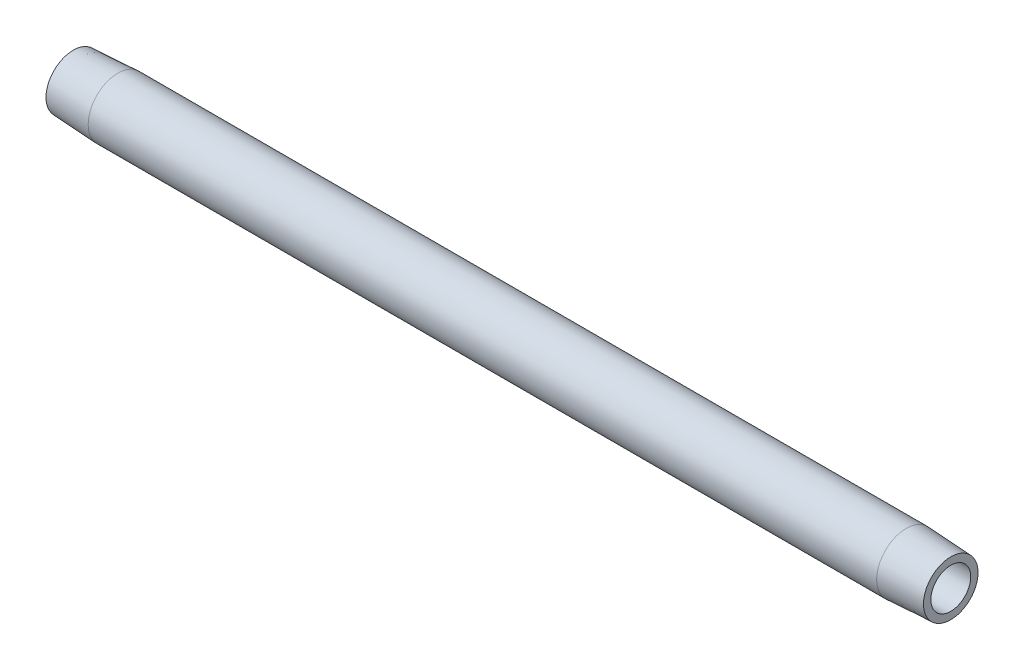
from build123d import *


with BuildPart() as part:
    # Sketch1 → Revolve1 (revolve)
    with BuildSketch(Plane(origin=(0, 0, 0), x_dir=(1, 0, 0), z_dir=(0, 1, 0)), mode=Mode.PRIVATE) as revolve1_sk:
        Polygon((203.2, 4.622776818), (0, 4.622776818), (0, 6.317526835), (10.3124, 6.857976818), (192.8876, 6.857976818), (203.2, 6.317526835), align=None)
    revolve(revolve1_sk.sketch.rotate(Axis((-6.375994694, 0, 0), (1, 0, 0)), 180), axis=Axis((-6.375994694, 0, 0), (1, 0, 0)))


solid = part.part
